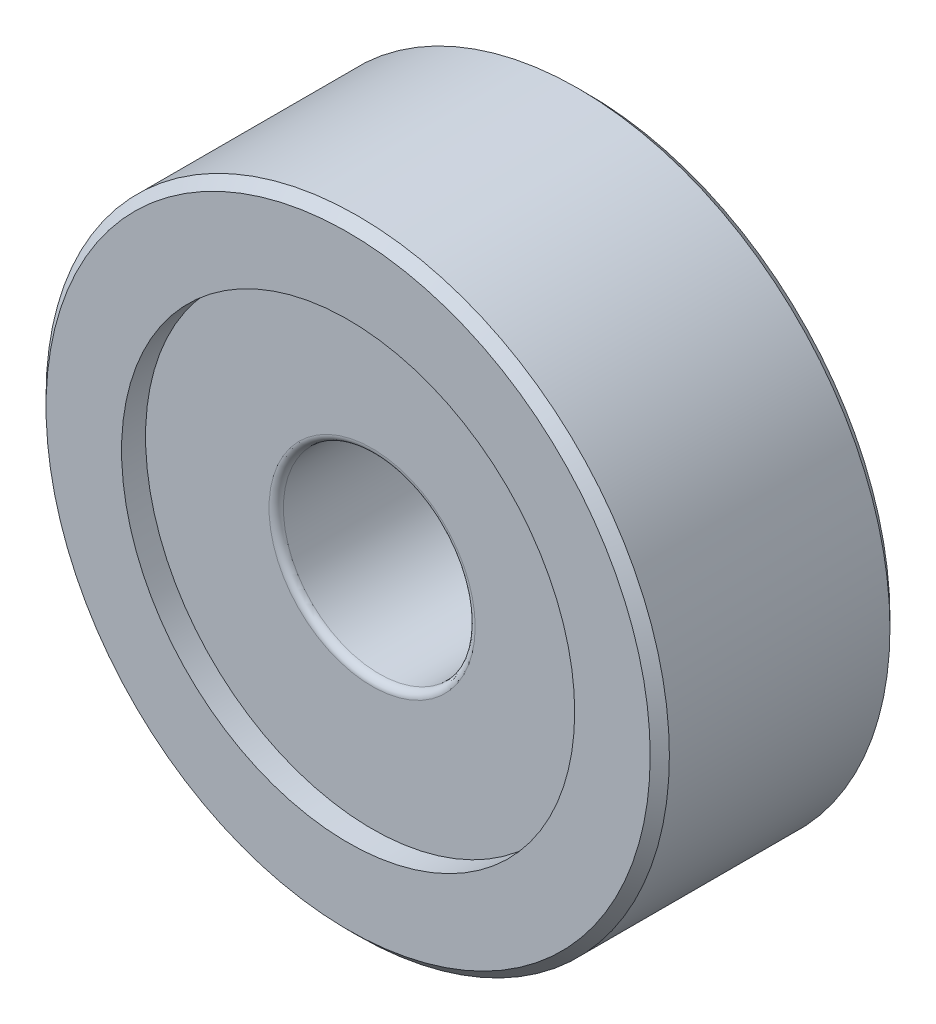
ISO-10303-21;
HEADER;
FILE_DESCRIPTION(('STEP AP214'),'2;1');
FILE_NAME('part.step','',(''),(''),'','','');
FILE_SCHEMA(('AUTOMOTIVE_DESIGN { 1 0 10303 214 1 1 1 1 }'));
ENDSEC;
DATA;
#1=APPLICATION_CONTEXT('core data for automotive mechanical design processes');
#2=APPLICATION_PROTOCOL_DEFINITION('international standard','automotive_design',2000,#1);
#3=PRODUCT_CONTEXT('',#1,'mechanical');
#4=PRODUCT('Part','Part','',(#3));
#5=PRODUCT_RELATED_PRODUCT_CATEGORY('part','',(#4));
#6=PRODUCT_DEFINITION_FORMATION('','',#4);
#7=PRODUCT_DEFINITION_CONTEXT('part definition',#1,'design');
#8=PRODUCT_DEFINITION('design','',#6,#7);
#9=PRODUCT_DEFINITION_SHAPE('','',#8);
#10=(LENGTH_UNIT() NAMED_UNIT(*) SI_UNIT(.MILLI.,.METRE.));
#11=(NAMED_UNIT(*) PLANE_ANGLE_UNIT() SI_UNIT($,.RADIAN.));
#12=(NAMED_UNIT(*) SI_UNIT($,.STERADIAN.) SOLID_ANGLE_UNIT());
#13=UNCERTAINTY_MEASURE_WITH_UNIT(LENGTH_MEASURE(1.E-05),#10,'distance_accuracy_value','');
#14=(GEOMETRIC_REPRESENTATION_CONTEXT(3) GLOBAL_UNCERTAINTY_ASSIGNED_CONTEXT((#13)) GLOBAL_UNIT_ASSIGNED_CONTEXT((#10,
#11,#12)) REPRESENTATION_CONTEXT('',''));
#15=CARTESIAN_POINT('',(0.,0.,0.));
#16=DIRECTION('',(0.,0.,1.));
#17=DIRECTION('',(1.,0.,0.));
#18=AXIS2_PLACEMENT_3D('',#15,#16,#17);
#19=CARTESIAN_POINT('',(0.,0.,1.85));
#20=DIRECTION('',(0.,0.,1.));
#21=DIRECTION('',(1.,0.,0.));
#22=AXIS2_PLACEMENT_3D('',#19,#20,#21);
#23=TOROIDAL_SURFACE('',#22,2.15,0.149999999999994);
#24=CARTESIAN_POINT('',(0.,0.,1.85000000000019));
#25=DIRECTION('',(0.,0.,1.));
#26=DIRECTION('',(1.,0.,0.));
#27=AXIS2_PLACEMENT_3D('',#24,#25,#26);
#28=CIRCLE('',#27,2.);
#29=CARTESIAN_POINT('',(2.,0.,1.85000000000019));
#30=VERTEX_POINT('',#29);
#31=EDGE_CURVE('E8',#30,#30,#28,.T.);
#32=ORIENTED_EDGE('',*,*,#31,.F.);
#33=EDGE_LOOP('',(#32));
#34=FACE_BOUND('',#33,.T.);
#35=CARTESIAN_POINT('',(0.,0.,2.));
#36=DIRECTION('',(0.,0.,1.));
#37=DIRECTION('',(1.,0.,0.));
#38=AXIS2_PLACEMENT_3D('',#35,#36,#37);
#39=CIRCLE('',#38,2.15);
#40=CARTESIAN_POINT('',(2.15,0.,2.));
#41=VERTEX_POINT('',#40);
#42=EDGE_CURVE('E52',#41,#41,#39,.T.);
#43=ORIENTED_EDGE('',*,*,#42,.T.);
#44=EDGE_LOOP('',(#43));
#45=FACE_BOUND('',#44,.T.);
#46=ADVANCED_FACE('F12',(#34,#45),#23,.T.);
#47=CARTESIAN_POINT('',(0.,0.,5.5));
#48=DIRECTION('',(0.,0.,1.));
#49=DIRECTION('',(1.,0.,0.));
#50=AXIS2_PLACEMENT_3D('',#47,#48,#49);
#51=CYLINDRICAL_SURFACE('',#50,2.);
#52=CARTESIAN_POINT('',(0.,0.,-1.84999999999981));
#53=DIRECTION('',(0.,0.,1.));
#54=DIRECTION('',(1.,0.,0.));
#55=AXIS2_PLACEMENT_3D('',#52,#53,#54);
#56=CIRCLE('',#55,2.);
#57=CARTESIAN_POINT('',(2.,0.,-1.84999999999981));
#58=VERTEX_POINT('',#57);
#59=EDGE_CURVE('E18',#58,#58,#56,.T.);
#60=ORIENTED_EDGE('',*,*,#59,.F.);
#61=EDGE_LOOP('',(#60));
#62=FACE_BOUND('',#61,.T.);
#63=ORIENTED_EDGE('',*,*,#31,.T.);
#64=EDGE_LOOP('',(#63));
#65=FACE_BOUND('',#64,.T.);
#66=ADVANCED_FACE('F113',(#62,#65),#51,.F.);
#67=CARTESIAN_POINT('',(0.,0.,-1.84999999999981));
#68=DIRECTION('',(0.,0.,1.));
#69=DIRECTION('',(1.,0.,0.));
#70=AXIS2_PLACEMENT_3D('',#67,#68,#69);
#71=TOROIDAL_SURFACE('',#70,2.15,0.149999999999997);
#72=CARTESIAN_POINT('',(0.,0.,-1.9999999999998));
#73=DIRECTION('',(0.,0.,1.));
#74=DIRECTION('',(1.,0.,0.));
#75=AXIS2_PLACEMENT_3D('',#72,#73,#74);
#76=CIRCLE('',#75,2.15000000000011);
#77=CARTESIAN_POINT('',(2.15000000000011,0.,-1.9999999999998));
#78=VERTEX_POINT('',#77);
#79=EDGE_CURVE('E22',#78,#78,#76,.T.);
#80=ORIENTED_EDGE('',*,*,#79,.F.);
#81=EDGE_LOOP('',(#80));
#82=FACE_BOUND('',#81,.T.);
#83=ORIENTED_EDGE('',*,*,#59,.T.);
#84=EDGE_LOOP('',(#83));
#85=FACE_BOUND('',#84,.T.);
#86=ADVANCED_FACE('F108',(#82,#85),#71,.T.);
#87=CARTESIAN_POINT('',(0.,2.15000000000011,-1.9999999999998));
#88=DIRECTION('',(0.,0.,1.));
#89=DIRECTION('',(1.,0.,0.));
#90=AXIS2_PLACEMENT_3D('',#87,#88,#89);
#91=PLANE('',#90);
#92=CARTESIAN_POINT('',(0.,0.,-1.9999999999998));
#93=DIRECTION('',(0.,0.,1.));
#94=DIRECTION('',(1.,0.,0.));
#95=AXIS2_PLACEMENT_3D('',#92,#93,#94);
#96=CIRCLE('',#95,4.725);
#97=CARTESIAN_POINT('',(4.725,0.,-1.9999999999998));
#98=VERTEX_POINT('',#97);
#99=EDGE_CURVE('E26',#98,#98,#96,.T.);
#100=ORIENTED_EDGE('',*,*,#99,.F.);
#101=EDGE_LOOP('',(#100));
#102=FACE_BOUND('',#101,.T.);
#103=ORIENTED_EDGE('',*,*,#79,.T.);
#104=EDGE_LOOP('',(#103));
#105=FACE_BOUND('',#104,.T.);
#106=ADVANCED_FACE('F102',(#102,#105),#91,.F.);
#107=CARTESIAN_POINT('',(0.,0.,5.5));
#108=DIRECTION('',(0.,0.,1.));
#109=DIRECTION('',(1.,0.,0.));
#110=AXIS2_PLACEMENT_3D('',#107,#108,#109);
#111=CYLINDRICAL_SURFACE('',#110,4.725);
#112=CARTESIAN_POINT('',(0.,0.,-2.49999999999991));
#113=DIRECTION('',(0.,0.,1.));
#114=DIRECTION('',(1.,0.,0.));
#115=AXIS2_PLACEMENT_3D('',#112,#113,#114);
#116=CIRCLE('',#115,4.725);
#117=CARTESIAN_POINT('',(4.725,0.,-2.49999999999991));
#118=VERTEX_POINT('',#117);
#119=EDGE_CURVE('E31',#118,#118,#116,.T.);
#120=ORIENTED_EDGE('',*,*,#119,.F.);
#121=EDGE_LOOP('',(#120));
#122=FACE_BOUND('',#121,.T.);
#123=ORIENTED_EDGE('',*,*,#99,.T.);
#124=EDGE_LOOP('',(#123));
#125=FACE_BOUND('',#124,.T.);
#126=ADVANCED_FACE('F96',(#122,#125),#111,.F.);
#127=CARTESIAN_POINT('',(0.,6.3,-2.49999999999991));
#128=DIRECTION('',(0.,0.,1.));
#129=DIRECTION('',(1.,0.,0.));
#130=AXIS2_PLACEMENT_3D('',#127,#128,#129);
#131=PLANE('',#130);
#132=CARTESIAN_POINT('',(0.,0.,-2.49999999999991));
#133=DIRECTION('',(0.,0.,1.));
#134=DIRECTION('',(1.,0.,0.));
#135=AXIS2_PLACEMENT_3D('',#132,#133,#134);
#136=CIRCLE('',#135,6.3);
#137=CARTESIAN_POINT('',(6.3,0.,-2.49999999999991));
#138=VERTEX_POINT('',#137);
#139=EDGE_CURVE('E34',#138,#138,#136,.T.);
#140=ORIENTED_EDGE('',*,*,#139,.F.);
#141=EDGE_LOOP('',(#140));
#142=FACE_BOUND('',#141,.T.);
#143=ORIENTED_EDGE('',*,*,#119,.T.);
#144=EDGE_LOOP('',(#143));
#145=FACE_BOUND('',#144,.T.);
#146=ADVANCED_FACE('F90',(#142,#145),#131,.F.);
#147=CARTESIAN_POINT('',(0.,0.,-2.49999999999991));
#148=DIRECTION('',(0.,0.,1.));
#149=DIRECTION('',(1.,0.,0.));
#150=AXIS2_PLACEMENT_3D('',#147,#148,#149);
#151=CONICAL_SURFACE('',#150,6.3,0.785398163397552);
#152=CARTESIAN_POINT('',(0.,0.,-2.3));
#153=DIRECTION('',(0.,0.,1.));
#154=DIRECTION('',(1.,0.,0.));
#155=AXIS2_PLACEMENT_3D('',#152,#153,#154);
#156=CIRCLE('',#155,6.5);
#157=CARTESIAN_POINT('',(6.5,0.,-2.3));
#158=VERTEX_POINT('',#157);
#159=EDGE_CURVE('E37',#158,#158,#156,.T.);
#160=ORIENTED_EDGE('',*,*,#159,.F.);
#161=EDGE_LOOP('',(#160));
#162=FACE_BOUND('',#161,.T.);
#163=ORIENTED_EDGE('',*,*,#139,.T.);
#164=EDGE_LOOP('',(#163));
#165=FACE_BOUND('',#164,.T.);
#166=ADVANCED_FACE('F84',(#162,#165),#151,.T.);
#167=CARTESIAN_POINT('',(0.,0.,5.5));
#168=DIRECTION('',(0.,0.,1.));
#169=DIRECTION('',(1.,0.,0.));
#170=AXIS2_PLACEMENT_3D('',#167,#168,#169);
#171=CYLINDRICAL_SURFACE('',#170,6.5);
#172=CARTESIAN_POINT('',(0.,0.,2.3));
#173=DIRECTION('',(0.,0.,1.));
#174=DIRECTION('',(1.,0.,0.));
#175=AXIS2_PLACEMENT_3D('',#172,#173,#174);
#176=CIRCLE('',#175,6.5);
#177=CARTESIAN_POINT('',(6.5,0.,2.3));
#178=VERTEX_POINT('',#177);
#179=EDGE_CURVE('E40',#178,#178,#176,.T.);
#180=ORIENTED_EDGE('',*,*,#179,.F.);
#181=EDGE_LOOP('',(#180));
#182=FACE_BOUND('',#181,.T.);
#183=ORIENTED_EDGE('',*,*,#159,.T.);
#184=EDGE_LOOP('',(#183));
#185=FACE_BOUND('',#184,.T.);
#186=ADVANCED_FACE('F78',(#182,#185),#171,.T.);
#187=CARTESIAN_POINT('',(0.,0.,2.3));
#188=DIRECTION('',(0.,0.,-1.));
#189=DIRECTION('',(-1.,0.,0.));
#190=AXIS2_PLACEMENT_3D('',#187,#188,#189);
#191=CONICAL_SURFACE('',#190,6.5,0.785398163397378);
#192=CARTESIAN_POINT('',(0.,0.,2.5));
#193=DIRECTION('',(0.,0.,1.));
#194=DIRECTION('',(1.,0.,0.));
#195=AXIS2_PLACEMENT_3D('',#192,#193,#194);
#196=CIRCLE('',#195,6.3);
#197=CARTESIAN_POINT('',(6.3,0.,2.5));
#198=VERTEX_POINT('',#197);
#199=EDGE_CURVE('E43',#198,#198,#196,.T.);
#200=ORIENTED_EDGE('',*,*,#199,.F.);
#201=EDGE_LOOP('',(#200));
#202=FACE_BOUND('',#201,.T.);
#203=ORIENTED_EDGE('',*,*,#179,.T.);
#204=EDGE_LOOP('',(#203));
#205=FACE_BOUND('',#204,.T.);
#206=ADVANCED_FACE('F72',(#202,#205),#191,.T.);
#207=CARTESIAN_POINT('',(0.,6.3,2.5));
#208=DIRECTION('',(0.,0.,-1.));
#209=DIRECTION('',(-1.,0.,0.));
#210=AXIS2_PLACEMENT_3D('',#207,#208,#209);
#211=PLANE('',#210);
#212=CARTESIAN_POINT('',(0.,0.,2.5));
#213=DIRECTION('',(0.,0.,1.));
#214=DIRECTION('',(1.,0.,0.));
#215=AXIS2_PLACEMENT_3D('',#212,#213,#214);
#216=CIRCLE('',#215,4.725);
#217=CARTESIAN_POINT('',(4.725,0.,2.5));
#218=VERTEX_POINT('',#217);
#219=EDGE_CURVE('E46',#218,#218,#216,.T.);
#220=ORIENTED_EDGE('',*,*,#219,.F.);
#221=EDGE_LOOP('',(#220));
#222=FACE_BOUND('',#221,.T.);
#223=ORIENTED_EDGE('',*,*,#199,.T.);
#224=EDGE_LOOP('',(#223));
#225=FACE_BOUND('',#224,.T.);
#226=ADVANCED_FACE('F66',(#222,#225),#211,.F.);
#227=CARTESIAN_POINT('',(0.,0.,5.5));
#228=DIRECTION('',(0.,0.,1.));
#229=DIRECTION('',(1.,0.,0.));
#230=AXIS2_PLACEMENT_3D('',#227,#228,#229);
#231=CYLINDRICAL_SURFACE('',#230,4.725);
#232=CARTESIAN_POINT('',(0.,0.,2.));
#233=DIRECTION('',(0.,0.,1.));
#234=DIRECTION('',(1.,0.,0.));
#235=AXIS2_PLACEMENT_3D('',#232,#233,#234);
#236=CIRCLE('',#235,4.725);
#237=CARTESIAN_POINT('',(4.725,0.,2.));
#238=VERTEX_POINT('',#237);
#239=EDGE_CURVE('E49',#238,#238,#236,.T.);
#240=ORIENTED_EDGE('',*,*,#239,.F.);
#241=EDGE_LOOP('',(#240));
#242=FACE_BOUND('',#241,.T.);
#243=ORIENTED_EDGE('',*,*,#219,.T.);
#244=EDGE_LOOP('',(#243));
#245=FACE_BOUND('',#244,.T.);
#246=ADVANCED_FACE('F60',(#242,#245),#231,.F.);
#247=CARTESIAN_POINT('',(0.,4.725,2.));
#248=DIRECTION('',(0.,0.,-1.));
#249=DIRECTION('',(-1.,0.,0.));
#250=AXIS2_PLACEMENT_3D('',#247,#248,#249);
#251=PLANE('',#250);
#252=ORIENTED_EDGE('',*,*,#42,.F.);
#253=EDGE_LOOP('',(#252));
#254=FACE_BOUND('',#253,.T.);
#255=ORIENTED_EDGE('',*,*,#239,.T.);
#256=EDGE_LOOP('',(#255));
#257=FACE_BOUND('',#256,.T.);
#258=ADVANCED_FACE('F57',(#254,#257),#251,.F.);
#259=CLOSED_SHELL('',(#46,#66,#86,#106,#126,#146,#166,#186,#206,#226,#246,#258));
#260=MANIFOLD_SOLID_BREP('B1',#259);
#261=ADVANCED_BREP_SHAPE_REPRESENTATION('',(#18,#260),#14);
#262=SHAPE_DEFINITION_REPRESENTATION(#9,#261);
ENDSEC;
END-ISO-10303-21;
